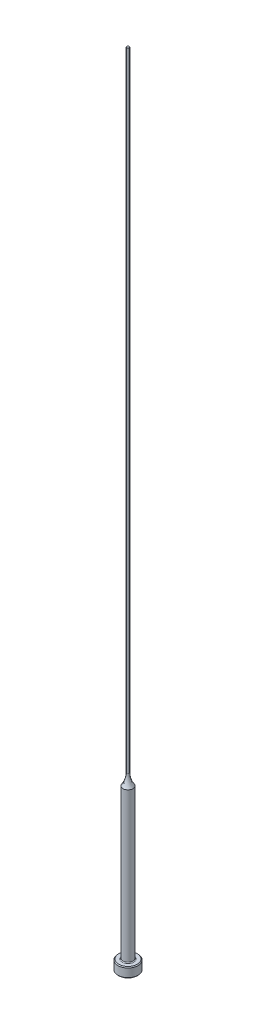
from build123d import *

# Parameters (mm, degrees)
CHAMFER1_SIZE = 0.254
FILLET1_R     = 0.254


with BuildPart() as part:
    # Sketch1 → Revolve1 (revolve)
    with BuildSketch(Plane.XY, mode=Mode.PRIVATE) as revolve1_sk:
        with BuildLine():
            Line((0, 0), (-3.175, 0))
            Line((-3.175, 0), (-3.175, 3.175))
            Line((-3.175, 3.175), (-1.5875, 3.175))
            Line((-1.5875, 3.175), (-1.5875, 50.8))
            ThreePointArc((-1.5875, 50.8), (-0.701386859, 52.557887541), (-0.39624, 54.50268843))
            Line((-0.39624, 54.50268843), (-0.39624, 254))
            Line((-0.39624, 254), (0, 254))
            Line((0, 254), (0, 0))
        make_face()
    revolve(revolve1_sk.sketch.rotate(Axis((0, 259.958771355, 0), (0, -1, 0)), 270), axis=Axis((0, 259.958771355, 0), (0, -1, 0)))

    # Chamfer1
    chamfer1_edges = [part.edges().sort_by_distance(p)[0] for p in [
        (0, 0, -3.175),
        (0, 3.175, -3.175),
    ]]
    chamfer(chamfer1_edges, length=CHAMFER1_SIZE)

    # Fillet1
    fillet1_edges = [part.edges().sort_by_distance(p)[0] for p in [
        (0, 3.175, -1.5875),
    ]]
    fillet(fillet1_edges, radius=FILLET1_R)


solid = part.part
